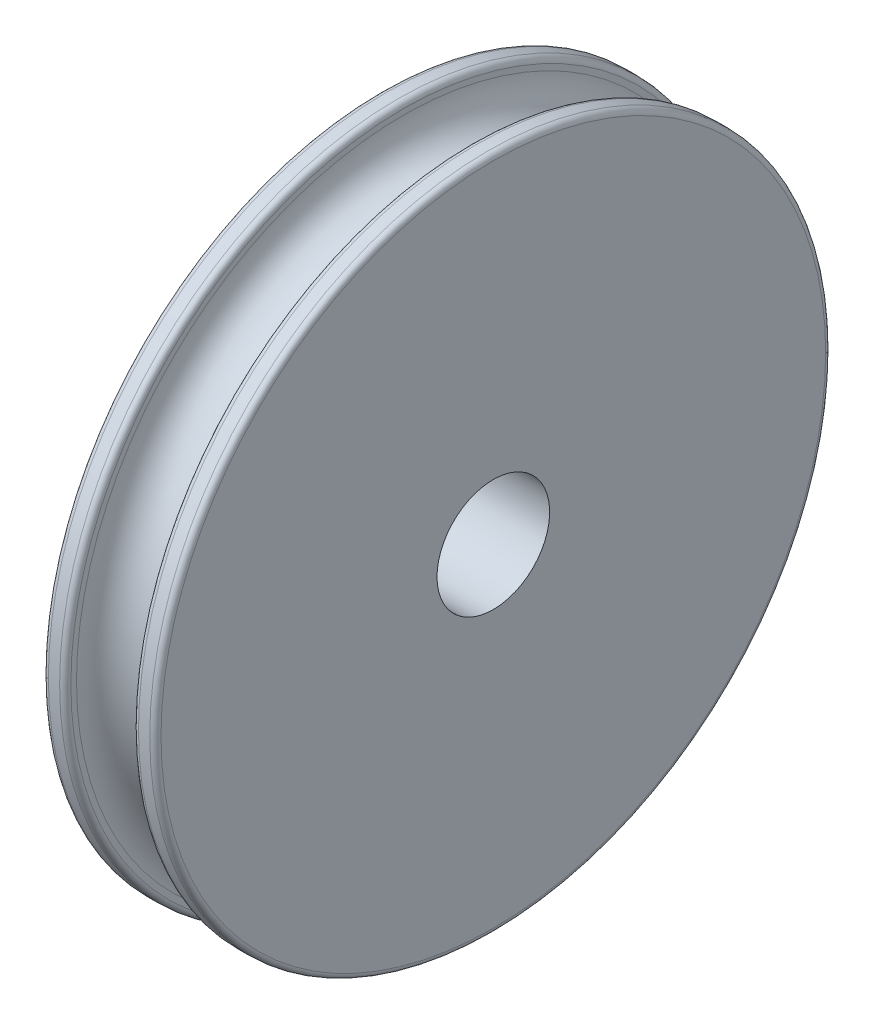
from build123d import *

# Parameters (mm, degrees)
ESQUISSE2_R             = 5
ENL_V_MAT_EXTRU_1_DEPTH = 10
ESQUISSE4_R             = 2
BOSS_EXTRU_1_DEPTH      = 2


with BuildPart() as part:
    # Esquisse1 → R_volution1 (revolve)
    with BuildSketch(Plane.XY, mode=Mode.PRIVATE) as r_volution1_sk:
        with BuildLine():
            Line((-5, 0), (-5, 29.5))
            ThreePointArc((-5, 29.5), (-4.853553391, 29.853553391), (-4.5, 30))
            Line((-4.5, 30), (-3.5, 30))
            ThreePointArc((-3.5, 30), (-3.146446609, 29.853553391), (-3, 29.5))
            Line((-3, 29.5), (-3, 29))
            ThreePointArc((-3, 29), (0, 26), (3, 29))
            Line((3, 29), (3, 29.5))
            ThreePointArc((3, 29.5), (3.146446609, 29.853553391), (3.5, 30))
            Line((3.5, 30), (4.5, 30))
            ThreePointArc((4.5, 30), (4.853553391, 29.853553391), (5, 29.5))
            Line((5, 29.5), (5, 0))
            Line((5, 0), (-5, 0))
        make_face()
    revolve(r_volution1_sk.sketch.rotate(Axis((-15.155672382, 0, 0), (1, 0, 0)), 90), axis=Axis((-15.155672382, 0, 0), (1, 0, 0)))

    # Esquisse2 → Enl_v. mat.-Extru.1 (cut)
    with BuildSketch(Plane.ZY.offset(5)):
        Circle(ESQUISSE2_R)
    extrude(amount=-ENL_V_MAT_EXTRU_1_DEPTH, mode=Mode.SUBTRACT)

    # Esquisse4 → Boss.-Extru.1 (add)
    with BuildSketch(Plane.ZY.offset(5)):
        with Locations(Location((0, 20, 0), (0, 0, 180))):
            Circle(ESQUISSE4_R)
    extrude(amount=BOSS_EXTRU_1_DEPTH)


solid = part.part
